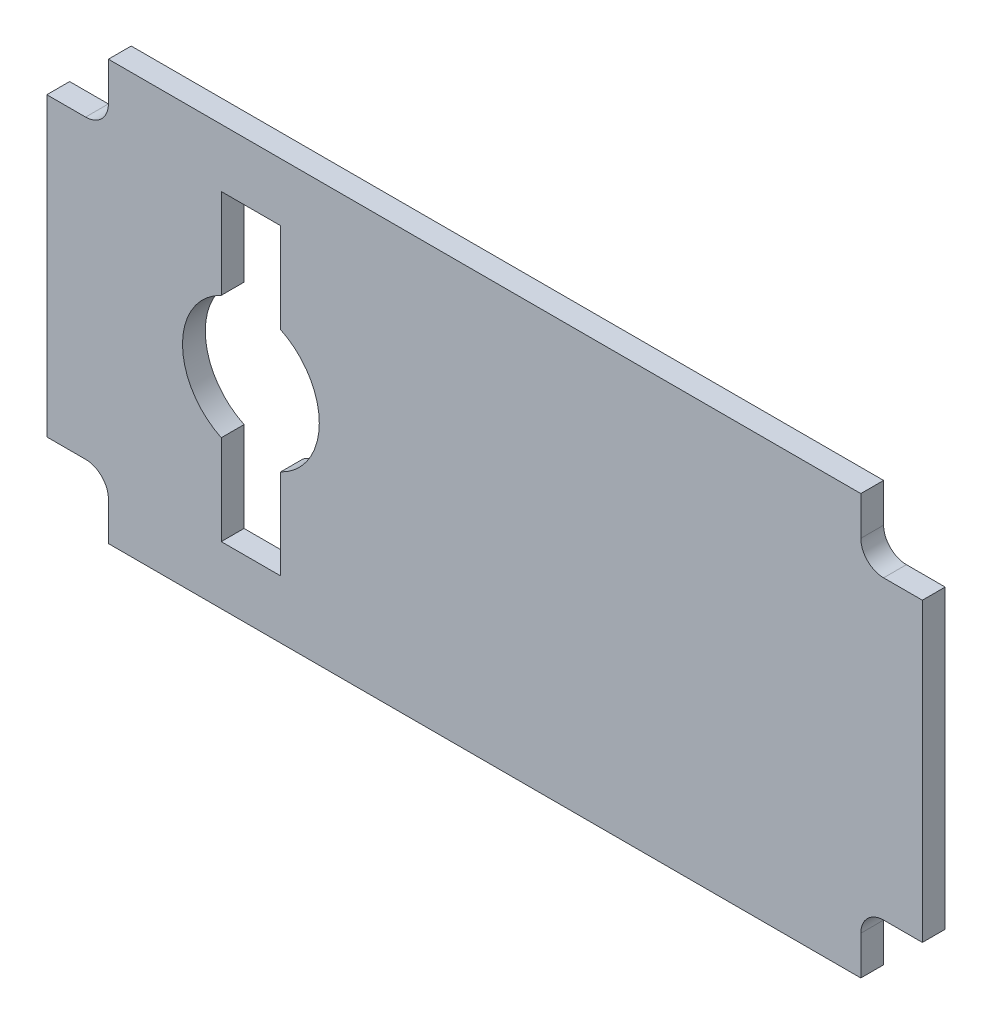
from build123d import *

# Parameters (mm, degrees)
Z_KLAD_PROTA_EN_DEPTH = 1


with BuildPart() as part:
    # Skica1 → Z_klad-Prota_en (new body)
    with BuildSketch(Plane.XY):
        with BuildLine():
            Line((-16.5, -9.2), (16.5, -9.2))
            Line((16.5, -9.2), (16.5, -7.5))
            ThreePointArc((16.5, -7.5), (16.792893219, -6.792893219), (17.5, -6.5))
            Line((17.5, -6.5), (19.2, -6.5))
            Line((19.2, -6.5), (19.2, 6.5))
            Line((19.2, 6.5), (17.5, 6.5))
            ThreePointArc((17.5, 6.5), (16.792893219, 6.792893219), (16.5, 7.5))
            Line((16.5, 7.5), (16.5, 9.2))
            Line((16.5, 9.2), (-16.5, 9.2))
            Line((-16.5, 9.2), (-16.5, 7.5))
            ThreePointArc((-16.5, 7.5), (-16.792893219, 6.792893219), (-17.5, 6.5))
            Line((-17.5, 6.5), (-19.2, 6.5))
            Line((-19.2, 6.5), (-19.2, -6.5))
            Line((-19.2, -6.5), (-17.5, -6.5))
            ThreePointArc((-17.5, -6.5), (-16.792893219, -6.792893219), (-16.5, -7.5))
            Line((-16.5, -7.5), (-16.5, -9.2))
        make_face()
        with BuildLine():
            Line((-11.55, 2.703701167), (-11.55, 6.65))
            Line((-11.55, 6.65), (-8.95, 6.65))
            Line((-8.95, 6.65), (-8.95, 2.703701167))
            ThreePointArc((-8.95, 2.703701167), (-7.25, 0), (-8.95, -2.703701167))
            Line((-8.95, -2.703701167), (-8.95, -6.65))
            Line((-8.95, -6.65), (-11.55, -6.65))
            Line((-11.55, -6.65), (-11.55, -2.703701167))
            ThreePointArc((-11.55, -2.703701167), (-13.25, 0), (-11.55, 2.703701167))
        make_face(mode=Mode.SUBTRACT)
    extrude(amount=Z_KLAD_PROTA_EN_DEPTH)


solid = part.part
